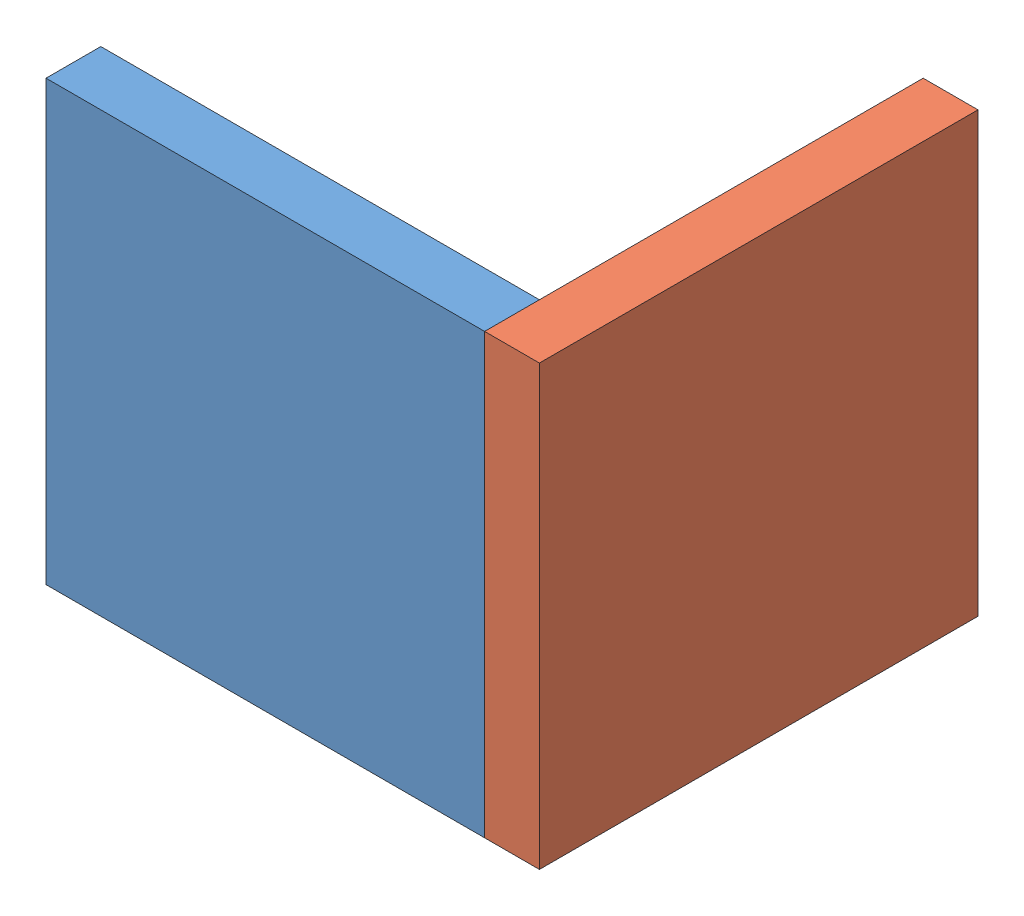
SolidWorks assembly JOINT.SLDASM, configuration Default (file format 3100). Lengths in mm.
Overall size (171.45 152.4 152.4).
2 component instances, 2 part files, 3 mates.
Components (placement in the parent):
- TAILS-1: TAILS.SLDPRT [Default] at origin size (168.28 152.4 19.06)
- SLOTS-1: SLOTS.SLDPRT [Default] at (85.725 0 -66.675) x (0 0 1) z (-1 0 0) size (152.4 152.4 19.05)
Mates (geometry in assembly coordinates):
- Coincident1: coincident aligned: plane of TAILS-1 through (76.2 76.2 -9.525) normal (0 1 0); plane of SLOTS-1 through (95.25 76.2 9.525) normal (0 1 0)
- Coincident2: coincident aligned: plane of TAILS-1 through (76.2 -76.2 9.525) normal (0 0 1); plane of SLOTS-1 through (95.25 -76.2 9.525) normal (0 0 1)
- Coincident3: coincident anti-aligned: plane of TAILS-1 through (76.2 -76.2 -9.525) normal (1 0 0); plane of SLOTS-1 through (76.2 -76.2 9.525) normal (-1 0 0)
